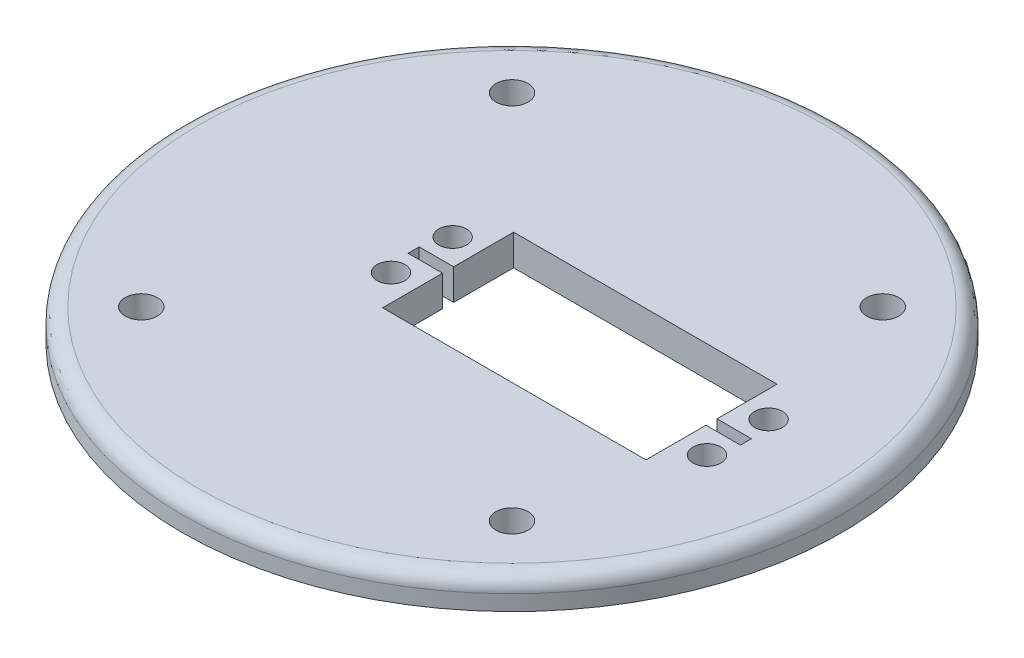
from build123d import *

# Parameters (mm, degrees)
SKETCH1_R           = 50.8
SKETCH1_R_2         = 2.15
SKETCH1_W           = 40.4
SKETCH1_H           = 20
BOSS_EXTRUDE1_DEPTH = 4.7625
SKETCH2_W           = 5.41
SKETCH2_H           = 1.7
CUT_EXTRUDE1_DEPTH  = 72.999731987
SKETCH3_R           = 2.48125
CUT_EXTRUDE2_DEPTH  = 72.999731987
FILLET1_R           = 2.38125
SKETCH4_W           = 40.6
SKETCH4_H           = 20.2
CUT_EXTRUDE3_DEPTH  = 72.999732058


with BuildPart() as part:
    # Sketch1 → Boss-Extrude1 (new body)
    with BuildSketch(Plane(origin=(0, 0, 0), x_dir=(1, 0, 0), z_dir=(0, 1, 0))):
        with Locations(Location((0, 0, 0), (0, 0, 90))):
            Circle(SKETCH1_R)
        with Locations(Location((-13.9, -4.75, 0), (0, 0, 90))):
            Circle(SKETCH1_R_2, mode=Mode.SUBTRACT)
        with Locations(Location((-13.9, 4.75, 0), (0, 0, 90))):
            Circle(SKETCH1_R_2, mode=Mode.SUBTRACT)
        with Locations(Location((34.8, -4.75, 0), (0, 0, 90))):
            Circle(SKETCH1_R_2, mode=Mode.SUBTRACT)
        with Locations(Location((34.8, 4.75, 0), (0, 0, 90))):
            Circle(SKETCH1_R_2, mode=Mode.SUBTRACT)
        with Locations((10.45, 0)):
            Rectangle(SKETCH1_W, SKETCH1_H, mode=Mode.SUBTRACT)
    extrude(amount=BOSS_EXTRUDE1_DEPTH)

    # Sketch2 → Cut-Extrude1 (cut, through all)
    with BuildSketch(Plane(origin=(0, 4.7625, 0), x_dir=(1, 0, 0), z_dir=(0, 1, 0))):
        with Locations((-12.455, 0)):
            Rectangle(SKETCH2_W, SKETCH2_H)
        with Locations((33.355, 0)):
            Rectangle(SKETCH2_W, SKETCH2_H)
    extrude(amount=-CUT_EXTRUDE1_DEPTH, mode=Mode.SUBTRACT)

    # Sketch3 → Cut-Extrude2 (cut, through all)
    with BuildSketch(Plane(origin=(0, 4.7625, 0), x_dir=(1, 0, 0), z_dir=(0, 1, 0))):
        with Locations(Location((-28.575, 28.575, 0), (0, 0, 270))):
            Circle(SKETCH3_R)
        with Locations(Location((28.575, 28.575, 0), (0, 0, 270))):
            Circle(SKETCH3_R)
        with Locations(Location((-28.575, -28.575, 0), (0, 0, 270))):
            Circle(SKETCH3_R)
        with Locations(Location((28.575, -28.575, 0), (0, 0, 270))):
            Circle(SKETCH3_R)
    extrude(amount=-CUT_EXTRUDE2_DEPTH, mode=Mode.SUBTRACT)

    # Fillet1
    fillet1_edges = [part.edges().sort_by_distance(p)[0] for p in [
        (0, 4.7625, 50.8),
    ]]
    fillet(fillet1_edges, radius=FILLET1_R)

    # Sketch4 → Cut-Extrude3 (cut, through all)
    with BuildSketch(Plane(origin=(0, 4.7625, 0), x_dir=(1, 0, 0), z_dir=(0, 1, 0))):
        with Locations((10.45, 0)):
            Rectangle(SKETCH4_W, SKETCH4_H)
    extrude(amount=-CUT_EXTRUDE3_DEPTH, mode=Mode.SUBTRACT)


solid = part.part
